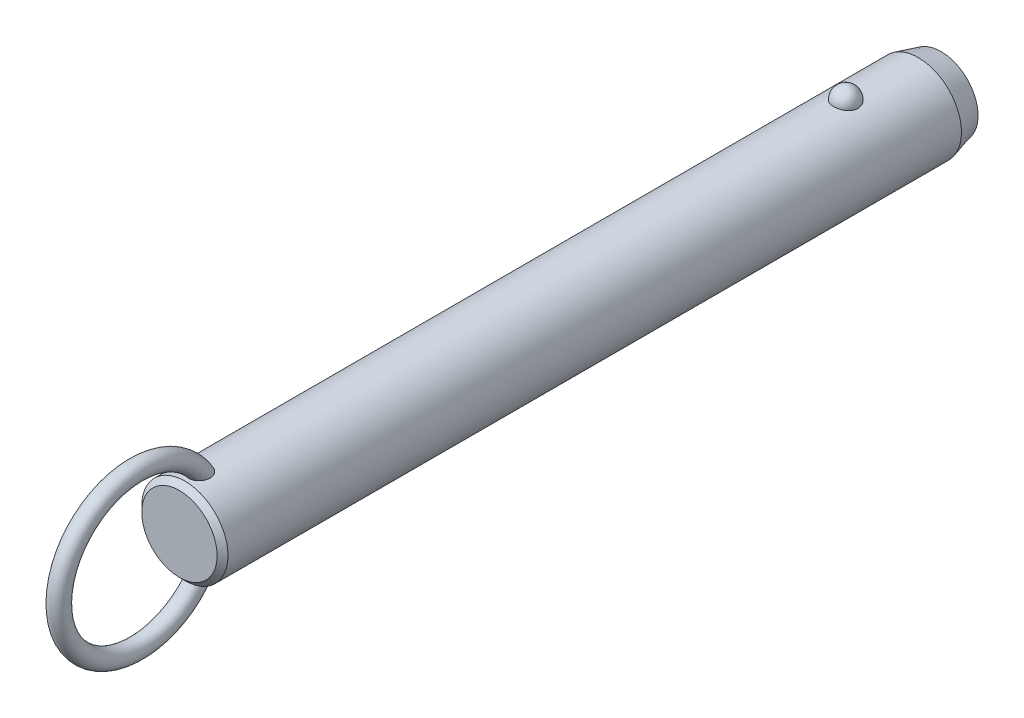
ISO-10303-21;
HEADER;
FILE_DESCRIPTION(('STEP AP214'),'2;1');
FILE_NAME('part.step','',(''),(''),'','','');
FILE_SCHEMA(('AUTOMOTIVE_DESIGN { 1 0 10303 214 1 1 1 1 }'));
ENDSEC;
DATA;
#1=APPLICATION_CONTEXT('core data for automotive mechanical design processes');
#2=APPLICATION_PROTOCOL_DEFINITION('international standard','automotive_design',2000,#1);
#3=PRODUCT_CONTEXT('',#1,'mechanical');
#4=PRODUCT('Part','Part','',(#3));
#5=PRODUCT_RELATED_PRODUCT_CATEGORY('part','',(#4));
#6=PRODUCT_DEFINITION_FORMATION('','',#4);
#7=PRODUCT_DEFINITION_CONTEXT('part definition',#1,'design');
#8=PRODUCT_DEFINITION('design','',#6,#7);
#9=PRODUCT_DEFINITION_SHAPE('','',#8);
#10=(LENGTH_UNIT() NAMED_UNIT(*) SI_UNIT(.MILLI.,.METRE.));
#11=(NAMED_UNIT(*) PLANE_ANGLE_UNIT() SI_UNIT($,.RADIAN.));
#12=(NAMED_UNIT(*) SI_UNIT($,.STERADIAN.) SOLID_ANGLE_UNIT());
#13=UNCERTAINTY_MEASURE_WITH_UNIT(LENGTH_MEASURE(1.E-05),#10,'distance_accuracy_value','');
#14=(GEOMETRIC_REPRESENTATION_CONTEXT(3) GLOBAL_UNCERTAINTY_ASSIGNED_CONTEXT((#13)) GLOBAL_UNIT_ASSIGNED_CONTEXT((#10,
#11,#12)) REPRESENTATION_CONTEXT('',''));
#15=CARTESIAN_POINT('',(0.,0.,0.));
#16=DIRECTION('',(0.,0.,1.));
#17=DIRECTION('',(1.,0.,0.));
#18=AXIS2_PLACEMENT_3D('',#15,#16,#17);
#19=CARTESIAN_POINT('',(0.,0.,134.6));
#20=DIRECTION('',(0.,0.,-1.));
#21=DIRECTION('',(-1.,0.,0.));
#22=AXIS2_PLACEMENT_3D('',#19,#20,#21);
#23=CYLINDRICAL_SURFACE('',#22,9.5);
#24=CARTESIAN_POINT('',(2.67259918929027,9.11631578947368,-2.70000000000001));
#25=CARTESIAN_POINT('',(2.6725968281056,9.11631786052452,-2.54909854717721));
#26=CARTESIAN_POINT('',(2.66030567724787,9.11994722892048,-2.39816735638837));
#27=CARTESIAN_POINT('',(2.6114347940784,9.13405924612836,-2.10058568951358));
#28=CARTESIAN_POINT('',(2.57484658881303,9.14454428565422,-1.95393672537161));
#29=CARTESIAN_POINT('',(2.47830875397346,9.17117631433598,-1.66916069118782));
#30=CARTESIAN_POINT('',(2.41836936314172,9.18732082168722,-1.53102991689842));
#31=CARTESIAN_POINT('',(2.27661331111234,9.22346780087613,-1.26705393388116));
#32=CARTESIAN_POINT('',(2.19479699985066,9.24347021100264,-1.14120852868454));
#33=CARTESIAN_POINT('',(2.01085282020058,9.28522401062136,-0.904632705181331));
#34=CARTESIAN_POINT('',(1.90862396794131,9.30698376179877,-0.793982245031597));
#35=CARTESIAN_POINT('',(1.6867437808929,9.34973971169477,-0.591607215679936));
#36=CARTESIAN_POINT('',(1.56709244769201,9.37073591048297,-0.499882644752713));
#37=CARTESIAN_POINT('',(1.31393976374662,9.40956370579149,-0.338167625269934));
#38=CARTESIAN_POINT('',(1.18048026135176,9.42740444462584,-0.268113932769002));
#39=CARTESIAN_POINT('',(0.903154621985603,9.45799906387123,-0.151390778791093));
#40=CARTESIAN_POINT('',(0.759289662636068,9.47075351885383,-0.104718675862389));
#41=CARTESIAN_POINT('',(0.468074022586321,9.48956256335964,-0.0367633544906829));
#42=CARTESIAN_POINT('',(0.320836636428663,9.49573643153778,-0.0150275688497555));
#43=CARTESIAN_POINT('',(0.0246714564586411,9.50112183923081,0.00396199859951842));
#44=CARTESIAN_POINT('',(-0.124256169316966,9.50033406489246,0.00121819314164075));
#45=CARTESIAN_POINT('',(-0.417264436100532,9.4919475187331,-0.0284441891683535));
#46=CARTESIAN_POINT('',(-0.56138413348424,9.48444885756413,-0.0550074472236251));
#47=CARTESIAN_POINT('',(-0.842986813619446,9.46357853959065,-0.131064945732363));
#48=CARTESIAN_POINT('',(-0.980469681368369,9.450206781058,-0.180559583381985));
#49=CARTESIAN_POINT('',(-1.24585005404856,9.41890822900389,-0.301476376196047));
#50=CARTESIAN_POINT('',(-1.37368611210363,9.40095498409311,-0.373026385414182));
#51=CARTESIAN_POINT('',(-1.61552738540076,9.36242964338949,-0.536025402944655));
#52=CARTESIAN_POINT('',(-1.72953116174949,9.34185727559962,-0.627476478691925));
#53=CARTESIAN_POINT('',(-1.9429225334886,9.29984568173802,-0.829844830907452));
#54=CARTESIAN_POINT('',(-2.04198021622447,9.27839736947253,-0.94110821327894));
#55=CARTESIAN_POINT('',(-2.22026460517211,9.23735994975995,-1.17883414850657));
#56=CARTESIAN_POINT('',(-2.29948985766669,9.21777097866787,-1.30529781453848));
#57=CARTESIAN_POINT('',(-2.43697287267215,9.18238994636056,-1.57158566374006));
#58=CARTESIAN_POINT('',(-2.49497068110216,9.16664569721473,-1.71155057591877));
#59=CARTESIAN_POINT('',(-2.5872073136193,9.14104303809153,-1.99961197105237));
#60=CARTESIAN_POINT('',(-2.62144683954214,9.13118445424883,-2.14770821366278));
#61=CARTESIAN_POINT('',(-2.66521466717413,9.11850622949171,-2.44715424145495));
#62=CARTESIAN_POINT('',(-2.67484831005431,9.11565658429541,-2.59848735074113));
#63=CARTESIAN_POINT('',(-2.66946735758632,9.11723375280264,-2.90067317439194));
#64=CARTESIAN_POINT('',(-2.65445345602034,9.12166036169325,-3.05152590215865));
#65=CARTESIAN_POINT('',(-2.60029711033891,9.13724422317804,-3.34766110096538));
#66=CARTESIAN_POINT('',(-2.56127978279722,9.14836656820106,-3.49296833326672));
#67=CARTESIAN_POINT('',(-2.46018844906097,9.17606676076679,-3.77477535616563));
#68=CARTESIAN_POINT('',(-2.39811349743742,9.1926448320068,-3.9112747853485));
#69=CARTESIAN_POINT('',(-2.25202303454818,9.22952198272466,-4.17244273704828));
#70=CARTESIAN_POINT('',(-2.16788714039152,9.24984129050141,-4.29704106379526));
#71=CARTESIAN_POINT('',(-1.9799408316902,9.29188255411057,-4.53013066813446));
#72=CARTESIAN_POINT('',(-1.87612963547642,9.31360456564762,-4.63862130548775));
#73=CARTESIAN_POINT('',(-1.65105429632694,9.35612959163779,-4.8369029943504));
#74=CARTESIAN_POINT('',(-1.52972405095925,9.37692871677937,-4.92661991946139));
#75=CARTESIAN_POINT('',(-1.27318250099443,9.41518970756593,-5.08429106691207));
#76=CARTESIAN_POINT('',(-1.13797219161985,9.432651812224,-5.15224684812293));
#77=CARTESIAN_POINT('',(-0.859280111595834,9.46208255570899,-5.26371827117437));
#78=CARTESIAN_POINT('',(-0.715925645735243,9.47411833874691,-5.30753421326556));
#79=CARTESIAN_POINT('',(-0.423550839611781,9.4916822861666,-5.37076321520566));
#80=CARTESIAN_POINT('',(-0.2745312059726,9.49721125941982,-5.39017930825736));
#81=CARTESIAN_POINT('',(0.0218446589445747,9.50110860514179,-5.40390587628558));
#82=CARTESIAN_POINT('',(0.16917707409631,9.49961381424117,-5.39869609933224));
#83=CARTESIAN_POINT('',(0.460808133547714,9.48993906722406,-5.36441955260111));
#84=CARTESIAN_POINT('',(0.605106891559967,9.48175936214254,-5.33535367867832));
#85=CARTESIAN_POINT('',(0.886027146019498,9.4596376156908,-5.25435587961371));
#86=CARTESIAN_POINT('',(1.02267710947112,9.44571881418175,-5.20251612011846));
#87=CARTESIAN_POINT('',(1.28523827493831,9.41358993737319,-5.07741549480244));
#88=CARTESIAN_POINT('',(1.41114877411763,9.39537958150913,-5.00415322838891));
#89=CARTESIAN_POINT('',(1.65085227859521,9.3562644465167,-4.83684599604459));
#90=CARTESIAN_POINT('',(1.76442346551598,9.33532178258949,-4.74249218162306));
#91=CARTESIAN_POINT('',(1.97425672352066,9.29321198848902,-4.53620389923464));
#92=CARTESIAN_POINT('',(2.07051582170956,9.27204482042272,-4.42426641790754));
#93=CARTESIAN_POINT('',(2.24490086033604,9.23139221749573,-4.18363183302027));
#94=CARTESIAN_POINT('',(2.32267019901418,9.21194380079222,-4.05466990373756));
#95=CARTESIAN_POINT('',(2.45584092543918,9.1773419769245,-3.78517836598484));
#96=CARTESIAN_POINT('',(2.5112497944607,9.16218713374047,-3.64465264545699));
#97=CARTESIAN_POINT('',(2.59380876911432,9.13913522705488,-3.37104301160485));
#98=CARTESIAN_POINT('',(2.62330266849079,9.13064624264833,-3.23871053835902));
#99=CARTESIAN_POINT('',(2.66269870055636,9.11923566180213,-2.97092664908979));
#100=CARTESIAN_POINT('',(2.67260130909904,9.11631393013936,-2.83547530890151));
#101=CARTESIAN_POINT('',(2.67259918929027,9.11631578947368,-2.70000000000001));
#102=B_SPLINE_CURVE_WITH_KNOTS('',3,(#24,#25,#26,#27,#28,#29,#30,#31,#32,#33,#34,#35,#36,#37,
#38,#39,#40,#41,#42,#43,#44,#45,#46,#47,#48,#49,#50,#51,#52,#53,#54,#55,#56,#57,#58,#59,#60,#61,
#62,#63,#64,#65,#66,#67,#68,#69,#70,#71,#72,#73,#74,#75,#76,#77,#78,#79,#80,#81,#82,#83,#84,#85,
#86,#87,#88,#89,#90,#91,#92,#93,#94,#95,#96,#97,#98,#99,#100,#101),.UNSPECIFIED.,.T.,.F.,(4,2,2,
2,2,2,2,2,2,2,2,2,2,2,2,2,2,2,2,2,2,2,2,2,2,2,2,2,2,2,2,2,2,2,2,2,2,2,4),(0.,0.452217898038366,
0.904593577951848,1.35677112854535,1.80894144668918,2.26340676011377,2.71787203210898,
3.17099820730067,3.62407318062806,4.0687883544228,4.51345969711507,4.95160616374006,
5.38976021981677,5.83050358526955,6.27129275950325,6.72071308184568,7.17016633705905,
7.62495278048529,8.07972578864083,8.53254856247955,8.98535859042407,9.43582813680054,
9.88631615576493,10.3393155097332,10.7923328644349,11.2471065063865,11.7018475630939,
12.150795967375,12.599688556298,13.0398725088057,13.4800399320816,13.9184421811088,
14.3568730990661,14.802202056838,15.2476074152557,15.7010097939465,16.1542603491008,
16.5602594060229,16.966248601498),.UNSPECIFIED.);
#103=CARTESIAN_POINT('',(2.67259918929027,9.11631578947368,-2.70000000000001));
#104=VERTEX_POINT('',#103);
#105=EDGE_CURVE('E41',#104,#104,#102,.T.);
#106=ORIENTED_EDGE('',*,*,#105,.T.);
#107=EDGE_LOOP('',(#106));
#108=FACE_BOUND('',#107,.T.);
#109=CARTESIAN_POINT('',(0.,0.,142.92));
#110=DIRECTION('',(0.,0.,1.));
#111=DIRECTION('',(1.,0.,0.));
#112=AXIS2_PLACEMENT_3D('',#109,#110,#111);
#113=CIRCLE('',#112,9.5);
#114=CARTESIAN_POINT('',(9.5,0.,142.92));
#115=VERTEX_POINT('',#114);
#116=EDGE_CURVE('E10',#115,#115,#113,.F.);
#117=ORIENTED_EDGE('',*,*,#116,.T.);
#118=EDGE_LOOP('',(#117));
#119=FACE_BOUND('',#118,.T.);
#120=CARTESIAN_POINT('',(-0.697062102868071,-9.47439269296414,137.267808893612));
#121=CARTESIAN_POINT('',(-0.799579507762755,-9.46685146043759,137.307482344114));
#122=CARTESIAN_POINT('',(-0.898575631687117,-9.45788043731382,137.3559309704));
#123=CARTESIAN_POINT('',(-1.08670047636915,-9.43811593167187,137.468868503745));
#124=CARTESIAN_POINT('',(-1.17583204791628,-9.42732297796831,137.533352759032));
#125=CARTESIAN_POINT('',(-1.34179806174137,-9.40513672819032,137.676209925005));
#126=CARTESIAN_POINT('',(-1.41865133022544,-9.39374438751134,137.754561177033));
#127=CARTESIAN_POINT('',(-1.55860047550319,-9.37154196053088,137.922752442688));
#128=CARTESIAN_POINT('',(-1.62169476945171,-9.3607319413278,138.01259377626));
#129=CARTESIAN_POINT('',(-1.73527695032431,-9.34035749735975,138.204500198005));
#130=CARTESIAN_POINT('',(-1.78522266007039,-9.33085270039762,138.306891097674));
#131=CARTESIAN_POINT('',(-1.86924997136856,-9.3143834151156,138.518148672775));
#132=CARTESIAN_POINT('',(-1.90332570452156,-9.30741986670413,138.627017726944));
#133=CARTESIAN_POINT('',(-1.95893603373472,-9.29588482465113,138.860473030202));
#134=CARTESIAN_POINT('',(-1.97872420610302,-9.29165182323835,138.985489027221));
#135=CARTESIAN_POINT('',(-2.00062129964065,-9.28695978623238,139.237080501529));
#136=CARTESIAN_POINT('',(-2.00272284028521,-9.28650232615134,139.363656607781));
#137=CARTESIAN_POINT('',(-1.98958876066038,-9.28932750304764,139.636815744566));
#138=CARTESIAN_POINT('',(-1.97143366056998,-9.2932400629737,139.783251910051));
#139=CARTESIAN_POINT('',(-1.91479925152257,-9.30507151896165,140.072062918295));
#140=CARTESIAN_POINT('',(-1.87629122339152,-9.31299607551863,140.214431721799));
#141=CARTESIAN_POINT('',(-1.77225683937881,-9.33340232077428,140.515172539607));
#142=CARTESIAN_POINT('',(-1.70334898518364,-9.34641636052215,140.672369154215));
#143=CARTESIAN_POINT('',(-1.58111062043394,-9.36759153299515,140.897517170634));
#144=CARTESIAN_POINT('',(-1.53721459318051,-9.37492619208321,140.970796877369));
#145=CARTESIAN_POINT('',(-1.4430263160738,-9.38988566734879,141.11307405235));
#146=CARTESIAN_POINT('',(-1.39273721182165,-9.39751033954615,141.182073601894));
#147=CARTESIAN_POINT('',(-1.26775962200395,-9.41530678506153,141.336983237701));
#148=CARTESIAN_POINT('',(-1.19052326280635,-9.42548108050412,141.420871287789));
#149=CARTESIAN_POINT('',(-1.02420241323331,-9.44499825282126,141.576008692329));
#150=CARTESIAN_POINT('',(-0.93513986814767,-9.45434261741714,141.647280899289));
#151=CARTESIAN_POINT('',(-0.766610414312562,-9.46930670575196,141.758695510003));
#152=CARTESIAN_POINT('',(-0.689439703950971,-9.47529223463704,141.802235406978));
#153=CARTESIAN_POINT('',(-0.528942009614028,-9.48560294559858,141.87631336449));
#154=CARTESIAN_POINT('',(-0.445620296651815,-9.48992953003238,141.906862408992));
#155=CARTESIAN_POINT('',(-0.273901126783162,-9.49644161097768,141.952579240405));
#156=CARTESIAN_POINT('',(-0.18546574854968,-9.49860811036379,141.96761059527));
#157=CARTESIAN_POINT('',(-0.00734541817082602,-9.5004135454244,141.980149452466));
#158=CARTESIAN_POINT('',(0.0823387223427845,-9.50005405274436,141.977667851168));
#159=CARTESIAN_POINT('',(0.24767927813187,-9.49708301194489,141.956995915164));
#160=CARTESIAN_POINT('',(0.323620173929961,-9.49477609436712,141.940930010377));
#161=CARTESIAN_POINT('',(0.471981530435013,-9.48855917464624,141.897172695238));
#162=CARTESIAN_POINT('',(0.544400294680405,-9.48464840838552,141.869475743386));
#163=CARTESIAN_POINT('',(0.708947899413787,-9.47398336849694,141.79280266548));
#164=CARTESIAN_POINT('',(0.799149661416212,-9.46671310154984,141.739774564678));
#165=CARTESIAN_POINT('',(0.969783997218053,-9.45076225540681,141.619973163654));
#166=CARTESIAN_POINT('',(1.050194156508,-9.44207854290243,141.553169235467));
#167=CARTESIAN_POINT('',(1.23092343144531,-9.42051459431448,141.380759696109));
#168=CARTESIAN_POINT('',(1.32652499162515,-9.40733378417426,141.27026193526));
#169=CARTESIAN_POINT('',(1.49893121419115,-9.38140745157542,141.035561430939));
#170=CARTESIAN_POINT('',(1.5757161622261,-9.36866239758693,140.911344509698));
#171=CARTESIAN_POINT('',(1.71285426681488,-9.34457644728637,140.649389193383));
#172=CARTESIAN_POINT('',(1.77266365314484,-9.33328726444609,140.51136233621));
#173=CARTESIAN_POINT('',(1.87239208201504,-9.31379209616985,140.228051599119));
#174=CARTESIAN_POINT('',(1.91230158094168,-9.3055875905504,140.082764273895));
#175=CARTESIAN_POINT('',(1.97604189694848,-9.29228394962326,139.762028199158));
#176=CARTESIAN_POINT('',(1.9958743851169,-9.28797202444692,139.585724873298));
#177=CARTESIAN_POINT('',(2.0029570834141,-9.28645519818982,139.232414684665));
#178=CARTESIAN_POINT('',(1.99025930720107,-9.28923895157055,139.055409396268));
#179=CARTESIAN_POINT('',(1.93735479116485,-9.30038134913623,138.756338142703));
#180=CARTESIAN_POINT('',(1.90576827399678,-9.30697680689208,138.632667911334));
#181=CARTESIAN_POINT('',(1.8228748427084,-9.32356855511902,138.392329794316));
#182=CARTESIAN_POINT('',(1.77158213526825,-9.33356239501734,138.275656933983));
#183=CARTESIAN_POINT('',(1.64885744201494,-9.35602275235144,138.052706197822));
#184=CARTESIAN_POINT('',(1.57730995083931,-9.36850332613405,137.946492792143));
#185=CARTESIAN_POINT('',(1.41543264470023,-9.39431873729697,137.749553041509));
#186=CARTESIAN_POINT('',(1.32510883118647,-9.40765330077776,137.658821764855));
#187=CARTESIAN_POINT('',(1.13846223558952,-9.43195720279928,137.505033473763));
#188=CARTESIAN_POINT('',(1.04369890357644,-9.44302894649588,137.440094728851));
#189=CARTESIAN_POINT('',(0.843965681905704,-9.46296805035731,137.328038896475));
#190=CARTESIAN_POINT('',(0.739000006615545,-9.47183631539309,137.280914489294));
#191=CARTESIAN_POINT('',(0.528175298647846,-9.48586140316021,137.208117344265));
#192=CARTESIAN_POINT('',(0.422686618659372,-9.49119633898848,137.18140249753));
#193=CARTESIAN_POINT('',(0.208590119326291,-9.49831365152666,137.146013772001));
#194=CARTESIAN_POINT('',(0.0999817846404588,-9.500095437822,137.137342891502));
#195=CARTESIAN_POINT('',(-0.126104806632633,-9.49988861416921,137.138350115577));
#196=CARTESIAN_POINT('',(-0.243578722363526,-9.49757821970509,137.149594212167));
#197=CARTESIAN_POINT('',(-0.474390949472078,-9.48885165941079,137.193167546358));
#198=CARTESIAN_POINT('',(-0.587729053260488,-9.48243528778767,137.225497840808));
#199=CARTESIAN_POINT('',(-0.697062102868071,-9.47439269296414,137.267808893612));
#200=B_SPLINE_CURVE_WITH_KNOTS('',3,(#120,#121,#122,#123,#124,#125,#126,#127,#128,#129,#130,
#131,#132,#133,#134,#135,#136,#137,#138,#139,#140,#141,#142,#143,#144,#145,#146,#147,#148,#149,
#150,#151,#152,#153,#154,#155,#156,#157,#158,#159,#160,#161,#162,#163,#164,#165,#166,#167,#168,
#169,#170,#171,#172,#173,#174,#175,#176,#177,#178,#179,#180,#181,#182,#183,#184,#185,#186,#187,
#188,#189,#190,#191,#192,#193,#194,#195,#196,#197,#198,#199),.UNSPECIFIED.,.T.,.F.,(4,2,2,2,2,2,
2,2,2,2,2,2,2,2,2,2,2,2,2,2,2,2,2,2,2,2,2,2,2,2,2,2,2,2,2,2,2,2,2,4),(0.,0.330119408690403,
0.660143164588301,0.989655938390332,1.31920659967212,1.66074728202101,2.00241415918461,
2.38088696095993,2.75951768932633,3.20065679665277,3.64242004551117,4.15620996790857,
4.4131416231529,4.66994734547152,5.01228664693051,5.35399933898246,5.61943037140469,
5.88463652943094,6.15215502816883,6.4195070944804,6.65144391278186,6.88349136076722,
7.19641200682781,7.51003602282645,7.94779711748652,8.3860149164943,8.83699707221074,
9.28819530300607,9.81778662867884,10.34653170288,10.7284172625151,11.1100280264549,
11.4938603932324,11.8775702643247,12.2220189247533,12.5663259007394,12.8915939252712,
13.2169159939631,13.5689650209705,13.9210316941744),.UNSPECIFIED.);
#201=CARTESIAN_POINT('',(-0.697062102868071,-9.47439269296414,137.267808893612));
#202=VERTEX_POINT('',#201);
#203=EDGE_CURVE('E59',#202,#202,#200,.T.);
#204=ORIENTED_EDGE('',*,*,#203,.T.);
#205=EDGE_LOOP('',(#204));
#206=FACE_BOUND('',#205,.T.);
#207=CARTESIAN_POINT('',(-0.697062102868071,9.47439269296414,137.267808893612));
#208=CARTESIAN_POINT('',(-0.597792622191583,9.48169483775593,137.22939564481));
#209=CARTESIAN_POINT('',(-0.495106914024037,9.48766580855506,137.199168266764));
#210=CARTESIAN_POINT('',(-0.285876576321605,9.49627648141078,137.156032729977));
#211=CARTESIAN_POINT('',(-0.179324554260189,9.49890941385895,137.143159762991));
#212=CARTESIAN_POINT('',(0.0344157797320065,9.50053798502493,137.135166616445));
#213=CARTESIAN_POINT('',(0.141603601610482,9.49953613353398,137.140034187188));
#214=CARTESIAN_POINT('',(0.35356357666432,9.49401038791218,137.167365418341));
#215=CARTESIAN_POINT('',(0.458336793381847,9.48948807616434,137.18982117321));
#216=CARTESIAN_POINT('',(0.662493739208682,9.4774236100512,137.251671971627));
#217=CARTESIAN_POINT('',(0.761881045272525,9.46988348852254,137.291055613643));
#218=CARTESIAN_POINT('',(0.952608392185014,9.45260382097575,137.385634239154));
#219=CARTESIAN_POINT('',(1.04394806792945,9.44286417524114,137.440829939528));
#220=CARTESIAN_POINT('',(1.21712767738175,9.42211760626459,137.566066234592));
#221=CARTESIAN_POINT('',(1.29885671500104,9.41109835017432,137.636257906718));
#222=CARTESIAN_POINT('',(1.44978975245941,9.38903310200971,137.788980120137));
#223=CARTESIAN_POINT('',(1.51899278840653,9.37798710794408,137.871511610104));
#224=CARTESIAN_POINT('',(1.64602857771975,9.35654375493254,138.049776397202));
#225=CARTESIAN_POINT('',(1.70333052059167,9.34618688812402,138.145891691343));
#226=CARTESIAN_POINT('',(1.80259341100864,9.32755128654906,138.345897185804));
#227=CARTESIAN_POINT('',(1.84454942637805,9.31927322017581,138.449789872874));
#228=CARTESIAN_POINT('',(1.91637039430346,9.30478365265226,138.672213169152));
#229=CARTESIAN_POINT('',(1.944805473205,9.29882552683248,138.791219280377));
#230=CARTESIAN_POINT('',(1.98449865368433,9.29043398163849,139.032143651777));
#231=CARTESIAN_POINT('',(1.99574908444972,9.28800213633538,139.154063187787));
#232=CARTESIAN_POINT('',(2.00275141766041,9.28649645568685,139.416932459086));
#233=CARTESIAN_POINT('',(1.99588238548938,9.28799035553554,139.557952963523));
#234=CARTESIAN_POINT('',(1.96270559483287,9.29505517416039,139.837621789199));
#235=CARTESIAN_POINT('',(1.93637872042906,9.30063010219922,139.976267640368));
#236=CARTESIAN_POINT('',(1.85949176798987,9.31633564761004,140.272561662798));
#237=CARTESIAN_POINT('',(1.8054979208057,9.3270926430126,140.429290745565));
#238=CARTESIAN_POINT('',(1.67376869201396,9.35163064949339,140.732284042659));
#239=CARTESIAN_POINT('',(1.59603181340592,9.36541185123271,140.878547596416));
#240=CARTESIAN_POINT('',(1.4360277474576,9.39110706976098,141.125813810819));
#241=CARTESIAN_POINT('',(1.35831795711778,9.40278656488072,141.229791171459));
#242=CARTESIAN_POINT('',(1.18774483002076,9.42585025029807,141.424534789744));
#243=CARTESIAN_POINT('',(1.09490932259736,9.43723493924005,141.515324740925));
#244=CARTESIAN_POINT('',(0.92111037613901,9.45552616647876,141.65620334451));
#245=CARTESIAN_POINT('',(0.84373824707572,9.46281058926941,141.710656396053));
#246=CARTESIAN_POINT('',(0.681245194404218,9.47589120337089,141.806711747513));
#247=CARTESIAN_POINT('',(0.596135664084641,9.48168953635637,141.848332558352));
#248=CARTESIAN_POINT('',(0.433779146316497,9.49038144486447,141.910089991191));
#249=CARTESIAN_POINT('',(0.357459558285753,9.49359170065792,141.93260136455));
#250=CARTESIAN_POINT('',(0.202074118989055,9.49816761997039,141.964574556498));
#251=CARTESIAN_POINT('',(0.123010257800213,9.49953459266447,141.974045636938));
#252=CARTESIAN_POINT('',(-0.03573724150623,9.50026497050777,141.979114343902));
#253=CARTESIAN_POINT('',(-0.115421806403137,9.49962433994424,141.974684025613));
#254=CARTESIAN_POINT('',(-0.272823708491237,9.49640854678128,141.952296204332));
#255=CARTESIAN_POINT('',(-0.350540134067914,9.4938325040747,141.934332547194));
#256=CARTESIAN_POINT('',(-0.500580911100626,9.48709462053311,141.886802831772));
#257=CARTESIAN_POINT('',(-0.572979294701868,9.48296359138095,141.857461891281));
#258=CARTESIAN_POINT('',(-0.712864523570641,9.47347609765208,141.789008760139));
#259=CARTESIAN_POINT('',(-0.780349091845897,9.46811906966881,141.749892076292));
#260=CARTESIAN_POINT('',(-0.946309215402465,9.45329720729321,141.639432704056));
#261=CARTESIAN_POINT('',(-1.04090230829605,9.44321512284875,141.562329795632));
#262=CARTESIAN_POINT('',(-1.21661929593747,9.42219227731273,141.39409718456));
#263=CARTESIAN_POINT('',(-1.29770519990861,9.41124921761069,141.302929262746));
#264=CARTESIAN_POINT('',(-1.47319646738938,9.38563439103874,141.076162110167));
#265=CARTESIAN_POINT('',(-1.56208878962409,9.37102009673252,140.936289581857));
#266=CARTESIAN_POINT('',(-1.71623987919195,9.34401559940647,140.643950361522));
#267=CARTESIAN_POINT('',(-1.78147866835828,9.33162728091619,140.491473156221));
#268=CARTESIAN_POINT('',(-1.88853837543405,9.31055541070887,140.175647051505));
#269=CARTESIAN_POINT('',(-1.92998995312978,9.30193076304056,140.012168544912));
#270=CARTESIAN_POINT('',(-1.98590726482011,9.29015757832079,139.680526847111));
#271=CARTESIAN_POINT('',(-2.0004070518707,9.2870021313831,139.512369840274));
#272=CARTESIAN_POINT('',(-1.99964701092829,9.28716218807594,139.205080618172));
#273=CARTESIAN_POINT('',(-1.98908145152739,9.28945704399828,139.065936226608));
#274=CARTESIAN_POINT('',(-1.94566294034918,9.29865169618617,138.791153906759));
#275=CARTESIAN_POINT('',(-1.9128206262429,9.30554929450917,138.655514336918));
#276=CARTESIAN_POINT('',(-1.84582133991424,9.31898248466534,138.457802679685));
#277=CARTESIAN_POINT('',(-1.82038084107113,9.32400364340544,138.392583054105));
#278=CARTESIAN_POINT('',(-1.76350511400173,9.33492884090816,138.264903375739));
#279=CARTESIAN_POINT('',(-1.73207305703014,9.34083241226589,138.202441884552));
#280=CARTESIAN_POINT('',(-1.66324243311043,9.35333332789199,138.08094078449));
#281=CARTESIAN_POINT('',(-1.62584239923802,9.35993084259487,138.021902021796));
#282=CARTESIAN_POINT('',(-1.54527678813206,9.37356864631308,137.907987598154));
#283=CARTESIAN_POINT('',(-1.50211241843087,9.38060884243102,137.853111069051));
#284=CARTESIAN_POINT('',(-1.3768114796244,9.40004442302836,137.709961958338));
#285=CARTESIAN_POINT('',(-1.28916358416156,9.41261047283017,137.626429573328));
#286=CARTESIAN_POINT('',(-1.09996826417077,9.43658180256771,137.477236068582));
#287=CARTESIAN_POINT('',(-0.998461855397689,9.44799034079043,137.411523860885));
#288=CARTESIAN_POINT('',(-0.860188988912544,9.46103017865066,137.3394367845));
#289=CARTESIAN_POINT('',(-0.828141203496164,9.46389141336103,137.323851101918));
#290=CARTESIAN_POINT('',(-0.763210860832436,9.46934915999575,137.294473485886));
#291=CARTESIAN_POINT('',(-0.730328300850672,9.47194567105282,137.280681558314));
#292=CARTESIAN_POINT('',(-0.697062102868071,9.47439269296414,137.267808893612));
#293=B_SPLINE_CURVE_WITH_KNOTS('',3,(#207,#208,#209,#210,#211,#212,#213,#214,#215,#216,#217,
#218,#219,#220,#221,#222,#223,#224,#225,#226,#227,#228,#229,#230,#231,#232,#233,#234,#235,#236,
#237,#238,#239,#240,#241,#242,#243,#244,#245,#246,#247,#248,#249,#250,#251,#252,#253,#254,#255,
#256,#257,#258,#259,#260,#261,#262,#263,#264,#265,#266,#267,#268,#269,#270,#271,#272,#273,#274,
#275,#276,#277,#278,#279,#280,#281,#282,#283,#284,#285,#286,#287,#288,#289,#290,#291,#292),
.UNSPECIFIED.,.T.,.F.,(4,2,2,2,2,2,2,2,2,2,2,2,2,2,2,2,2,2,2,2,2,2,2,2,2,2,2,2,2,2,2,2,2,2,2,2,
2,2,2,2,2,2,4),(0.,0.319942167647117,0.640532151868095,0.96090081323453,1.2811255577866,
1.60113495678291,1.92115886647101,2.24457323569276,2.56801248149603,2.90371927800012,
3.23953387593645,3.60560313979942,3.97183576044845,4.39383693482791,4.8162532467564,
5.31257045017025,5.80891895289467,6.19868344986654,6.58773876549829,6.87145417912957,
7.15475838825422,7.39263751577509,7.63034760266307,7.86853584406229,8.10683246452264,
8.3406366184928,8.57454843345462,8.93983939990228,9.30614105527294,9.80266668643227,
10.2996107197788,10.8040753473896,11.3079021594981,11.7249776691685,12.1418541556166,
12.3521485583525,12.5623319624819,12.7725671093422,12.9827582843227,13.345827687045,
13.7078449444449,13.8150604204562,13.9222762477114),.UNSPECIFIED.);
#294=CARTESIAN_POINT('',(-0.697062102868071,9.47439269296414,137.267808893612));
#295=VERTEX_POINT('',#294);
#296=EDGE_CURVE('E67',#295,#295,#293,.T.);
#297=ORIENTED_EDGE('',*,*,#296,.T.);
#298=EDGE_LOOP('',(#297));
#299=FACE_BOUND('',#298,.T.);
#300=CARTESIAN_POINT('',(0.,0.,-18.6999999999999));
#301=DIRECTION('',(0.,0.,-1.));
#302=DIRECTION('',(-1.,0.,0.));
#303=AXIS2_PLACEMENT_3D('',#300,#301,#302);
#304=CIRCLE('',#303,9.5);
#305=CARTESIAN_POINT('',(-9.5,0.,-18.6999999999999));
#306=VERTEX_POINT('',#305);
#307=EDGE_CURVE('E56',#306,#306,#304,.F.);
#308=ORIENTED_EDGE('',*,*,#307,.T.);
#309=EDGE_LOOP('',(#308));
#310=FACE_BOUND('',#309,.T.);
#311=ADVANCED_FACE('F37',(#108,#119,#206,#299,#310),#23,.T.);
#312=CARTESIAN_POINT('',(0.,0.,-23.7));
#313=DIRECTION('',(0.,0.,-1.));
#314=DIRECTION('',(-1.,0.,0.));
#315=AXIS2_PLACEMENT_3D('',#312,#313,#314);
#316=PLANE('',#315);
#317=CARTESIAN_POINT('',(0.,0.,-23.7));
#318=DIRECTION('',(0.,0.,-1.));
#319=DIRECTION('',(-1.,0.,0.));
#320=AXIS2_PLACEMENT_3D('',#317,#318,#319);
#321=CIRCLE('',#320,8.16025403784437);
#322=CARTESIAN_POINT('',(-8.16025403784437,0.,-23.7));
#323=VERTEX_POINT('',#322);
#324=EDGE_CURVE('E66',#323,#323,#321,.T.);
#325=ORIENTED_EDGE('',*,*,#324,.T.);
#326=EDGE_LOOP('',(#325));
#327=FACE_BOUND('',#326,.T.);
#328=ADVANCED_FACE('F85',(#327),#316,.T.);
#329=CARTESIAN_POINT('',(0.,0.,-23.7));
#330=DIRECTION('',(0.,0.,1.));
#331=DIRECTION('',(1.,0.,0.));
#332=AXIS2_PLACEMENT_3D('',#329,#330,#331);
#333=CONICAL_SURFACE('',#332,8.16025403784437,0.261799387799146);
#334=ORIENTED_EDGE('',*,*,#307,.F.);
#335=EDGE_LOOP('',(#334));
#336=FACE_BOUND('',#335,.T.);
#337=ORIENTED_EDGE('',*,*,#324,.F.);
#338=EDGE_LOOP('',(#337));
#339=FACE_BOUND('',#338,.T.);
#340=ADVANCED_FACE('F83',(#336,#339),#333,.T.);
#341=CARTESIAN_POINT('',(0.,0.,144.12));
#342=DIRECTION('',(0.,0.,1.));
#343=DIRECTION('',(1.,0.,0.));
#344=AXIS2_PLACEMENT_3D('',#341,#342,#343);
#345=PLANE('',#344);
#346=CARTESIAN_POINT('',(0.,0.,144.12));
#347=DIRECTION('',(0.,0.,1.));
#348=DIRECTION('',(1.,0.,0.));
#349=AXIS2_PLACEMENT_3D('',#346,#347,#348);
#350=CIRCLE('',#349,8.29999999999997);
#351=CARTESIAN_POINT('',(8.29999999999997,0.,144.12));
#352=VERTEX_POINT('',#351);
#353=EDGE_CURVE('E50',#352,#352,#350,.T.);
#354=ORIENTED_EDGE('',*,*,#353,.T.);
#355=EDGE_LOOP('',(#354));
#356=FACE_BOUND('',#355,.T.);
#357=ADVANCED_FACE('F77',(#356),#345,.T.);
#358=CARTESIAN_POINT('',(0.,0.,153.65));
#359=DIRECTION('',(1.,0.,0.));
#360=DIRECTION('',(0.,0.,-1.));
#361=AXIS2_PLACEMENT_3D('',#358,#359,#360);
#362=TOROIDAL_SURFACE('',#361,17.05,2.);
#363=ORIENTED_EDGE('',*,*,#296,.F.);
#364=EDGE_LOOP('',(#363));
#365=FACE_BOUND('',#364,.T.);
#366=ORIENTED_EDGE('',*,*,#203,.F.);
#367=EDGE_LOOP('',(#366));
#368=FACE_BOUND('',#367,.T.);
#369=ADVANCED_FACE('F73',(#365,#368),#362,.T.);
#370=CARTESIAN_POINT('',(0.,0.,144.12));
#371=DIRECTION('',(0.,0.,-1.));
#372=DIRECTION('',(-1.,0.,0.));
#373=AXIS2_PLACEMENT_3D('',#370,#371,#372);
#374=CONICAL_SURFACE('',#373,8.29999999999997,0.785398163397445);
#375=ORIENTED_EDGE('',*,*,#116,.F.);
#376=EDGE_LOOP('',(#375));
#377=FACE_BOUND('',#376,.T.);
#378=ORIENTED_EDGE('',*,*,#353,.F.);
#379=EDGE_LOOP('',(#378));
#380=FACE_BOUND('',#379,.T.);
#381=ADVANCED_FACE('F39',(#377,#380),#374,.T.);
#382=CARTESIAN_POINT('',(0.,9.5,-2.70000000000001));
#383=DIRECTION('',(0.,1.,0.));
#384=DIRECTION('',(0.,0.,-1.));
#385=AXIS2_PLACEMENT_3D('',#382,#383,#384);
#386=SPHERICAL_SURFACE('',#385,2.7);
#387=ORIENTED_EDGE('',*,*,#105,.F.);
#388=EDGE_LOOP('',(#387));
#389=FACE_BOUND('',#388,.T.);
#390=ADVANCED_FACE('F79',(#389),#386,.T.);
#391=CLOSED_SHELL('',(#311,#328,#340,#357,#369,#381,#390));
#392=MANIFOLD_SOLID_BREP('B2',#391);
#393=ADVANCED_BREP_SHAPE_REPRESENTATION('',(#18,#392),#14);
#394=SHAPE_DEFINITION_REPRESENTATION(#9,#393);
ENDSEC;
END-ISO-10303-21;
